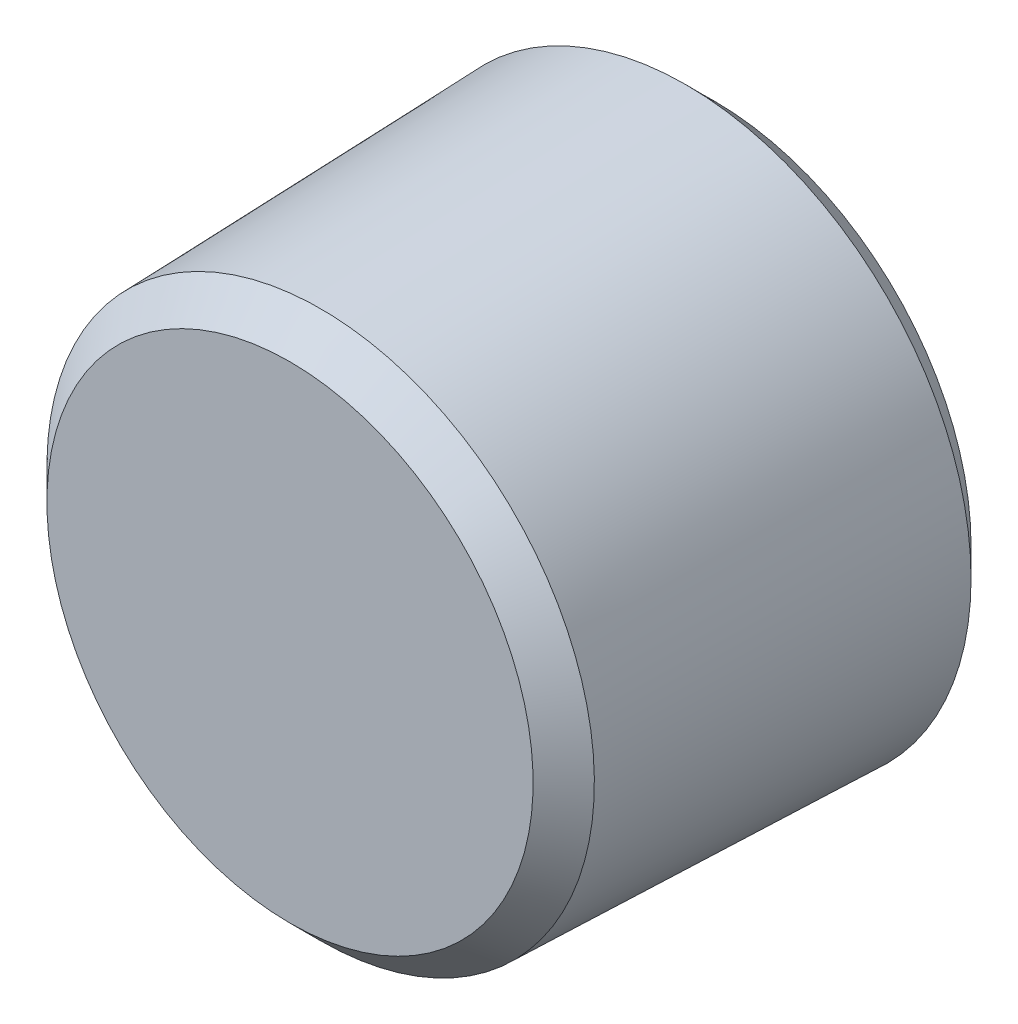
ISO-10303-21;
HEADER;
FILE_DESCRIPTION(('STEP AP214'),'2;1');
FILE_NAME('part.step','',(''),(''),'','','');
FILE_SCHEMA(('AUTOMOTIVE_DESIGN { 1 0 10303 214 1 1 1 1 }'));
ENDSEC;
DATA;
#1=APPLICATION_CONTEXT('core data for automotive mechanical design processes');
#2=APPLICATION_PROTOCOL_DEFINITION('international standard','automotive_design',2000,#1);
#3=PRODUCT_CONTEXT('',#1,'mechanical');
#4=PRODUCT('Part','Part','',(#3));
#5=PRODUCT_RELATED_PRODUCT_CATEGORY('part','',(#4));
#6=PRODUCT_DEFINITION_FORMATION('','',#4);
#7=PRODUCT_DEFINITION_CONTEXT('part definition',#1,'design');
#8=PRODUCT_DEFINITION('design','',#6,#7);
#9=PRODUCT_DEFINITION_SHAPE('','',#8);
#10=(LENGTH_UNIT() NAMED_UNIT(*) SI_UNIT(.MILLI.,.METRE.));
#11=(NAMED_UNIT(*) PLANE_ANGLE_UNIT() SI_UNIT($,.RADIAN.));
#12=(NAMED_UNIT(*) SI_UNIT($,.STERADIAN.) SOLID_ANGLE_UNIT());
#13=UNCERTAINTY_MEASURE_WITH_UNIT(LENGTH_MEASURE(1.E-05),#10,'distance_accuracy_value','');
#14=(GEOMETRIC_REPRESENTATION_CONTEXT(3) GLOBAL_UNCERTAINTY_ASSIGNED_CONTEXT((#13)) GLOBAL_UNIT_ASSIGNED_CONTEXT((#10,
#11,#12)) REPRESENTATION_CONTEXT('',''));
#15=CARTESIAN_POINT('',(0.,0.,0.));
#16=DIRECTION('',(0.,0.,1.));
#17=DIRECTION('',(1.,0.,0.));
#18=AXIS2_PLACEMENT_3D('',#15,#16,#17);
#19=CARTESIAN_POINT('',(0.,3.5,0.));
#20=DIRECTION('',(0.,0.,1.));
#21=DIRECTION('',(0.,-1.,0.));
#22=AXIS2_PLACEMENT_3D('',#19,#20,#21);
#23=PLANE('',#22);
#24=CARTESIAN_POINT('',(0.,0.,0.));
#25=DIRECTION('',(0.,0.,1.));
#26=DIRECTION('',(0.,-1.,0.));
#27=AXIS2_PLACEMENT_3D('',#24,#25,#26);
#28=CIRCLE('',#27,6.02764781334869);
#29=CARTESIAN_POINT('',(0.,-6.02764781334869,0.));
#30=VERTEX_POINT('',#29);
#31=EDGE_CURVE('E140',#30,#30,#28,.T.);
#32=ORIENTED_EDGE('',*,*,#31,.F.);
#33=EDGE_LOOP('',(#32));
#34=FACE_BOUND('',#33,.T.);
#35=DIRECTION('',(-0.5,0.866025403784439,0.));
#36=VECTOR('',#35,1.);
#37=CARTESIAN_POINT('',(4.04145188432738,0.,0.));
#38=LINE('',#37,#36);
#39=CARTESIAN_POINT('',(4.04145188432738,0.,0.));
#40=VERTEX_POINT('',#39);
#41=CARTESIAN_POINT('',(2.02072594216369,3.5,0.));
#42=VERTEX_POINT('',#41);
#43=EDGE_CURVE('E194',#40,#42,#38,.T.);
#44=ORIENTED_EDGE('',*,*,#43,.T.);
#45=DIRECTION('',(-1.,0.,0.));
#46=VECTOR('',#45,1.);
#47=CARTESIAN_POINT('',(2.02072594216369,3.5,0.));
#48=LINE('',#47,#46);
#49=CARTESIAN_POINT('',(-2.02072594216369,3.5,0.));
#50=VERTEX_POINT('',#49);
#51=EDGE_CURVE('E197',#42,#50,#48,.T.);
#52=ORIENTED_EDGE('',*,*,#51,.T.);
#53=DIRECTION('',(-0.5,-0.866025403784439,0.));
#54=VECTOR('',#53,1.);
#55=CARTESIAN_POINT('',(-2.02072594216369,3.5,0.));
#56=LINE('',#55,#54);
#57=CARTESIAN_POINT('',(-4.04145188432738,0.,0.));
#58=VERTEX_POINT('',#57);
#59=EDGE_CURVE('E213',#50,#58,#56,.T.);
#60=ORIENTED_EDGE('',*,*,#59,.T.);
#61=DIRECTION('',(0.5,-0.866025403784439,0.));
#62=VECTOR('',#61,1.);
#63=CARTESIAN_POINT('',(-4.04145188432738,0.,0.));
#64=LINE('',#63,#62);
#65=CARTESIAN_POINT('',(-2.02072594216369,-3.5,0.));
#66=VERTEX_POINT('',#65);
#67=EDGE_CURVE('E119',#58,#66,#64,.T.);
#68=ORIENTED_EDGE('',*,*,#67,.T.);
#69=DIRECTION('',(1.,0.,0.));
#70=VECTOR('',#69,1.);
#71=CARTESIAN_POINT('',(-2.02072594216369,-3.5,0.));
#72=LINE('',#71,#70);
#73=CARTESIAN_POINT('',(2.02072594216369,-3.5,0.));
#74=VERTEX_POINT('',#73);
#75=EDGE_CURVE('E237',#66,#74,#72,.T.);
#76=ORIENTED_EDGE('',*,*,#75,.T.);
#77=DIRECTION('',(0.5,0.866025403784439,0.));
#78=VECTOR('',#77,1.);
#79=CARTESIAN_POINT('',(2.02072594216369,-3.5,0.));
#80=LINE('',#79,#78);
#81=EDGE_CURVE('E130',#74,#40,#80,.T.);
#82=ORIENTED_EDGE('',*,*,#81,.T.);
#83=EDGE_LOOP('',(#44,#52,#60,#68,#76,#82));
#84=FACE_BOUND('',#83,.T.);
#85=ADVANCED_FACE('F36',(#34,#84),#23,.F.);
#86=CARTESIAN_POINT('',(0.,0.,10.));
#87=DIRECTION('',(0.,0.,-1.));
#88=DIRECTION('',(0.,1.,0.));
#89=AXIS2_PLACEMENT_3D('',#86,#87,#88);
#90=PLANE('',#89);
#91=CARTESIAN_POINT('',(0.,0.,10.));
#92=DIRECTION('',(0.,0.,1.));
#93=DIRECTION('',(0.,-1.,0.));
#94=AXIS2_PLACEMENT_3D('',#91,#92,#93);
#95=CIRCLE('',#94,5.725);
#96=CARTESIAN_POINT('',(0.,-5.725,10.));
#97=VERTEX_POINT('',#96);
#98=EDGE_CURVE('E11',#97,#97,#95,.T.);
#99=ORIENTED_EDGE('',*,*,#98,.T.);
#100=EDGE_LOOP('',(#99));
#101=FACE_BOUND('',#100,.T.);
#102=ADVANCED_FACE('F38',(#101),#90,.F.);
#103=CARTESIAN_POINT('',(0.,0.,9.27877712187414));
#104=DIRECTION('',(0.,0.,-1.));
#105=DIRECTION('',(0.,1.,0.));
#106=AXIS2_PLACEMENT_3D('',#103,#104,#105);
#107=CONICAL_SURFACE('',#106,6.44622287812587,0.785398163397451);
#108=ORIENTED_EDGE('',*,*,#98,.F.);
#109=EDGE_LOOP('',(#108));
#110=FACE_BOUND('',#109,.T.);
#111=CARTESIAN_POINT('',(0.,0.,9.27877712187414));
#112=DIRECTION('',(0.,0.,1.));
#113=DIRECTION('',(0.,-1.,0.));
#114=AXIS2_PLACEMENT_3D('',#111,#112,#113);
#115=CIRCLE('',#114,6.44622287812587);
#116=CARTESIAN_POINT('',(0.,-6.44622287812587,9.27877712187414));
#117=VERTEX_POINT('',#116);
#118=EDGE_CURVE('E44',#117,#117,#115,.T.);
#119=ORIENTED_EDGE('',*,*,#118,.T.);
#120=EDGE_LOOP('',(#119));
#121=FACE_BOUND('',#120,.T.);
#122=ADVANCED_FACE('F158',(#110,#121),#107,.T.);
#123=CARTESIAN_POINT('',(0.,0.,0.677491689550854));
#124=DIRECTION('',(0.,0.,-1.));
#125=DIRECTION('',(0.,1.,0.));
#126=AXIS2_PLACEMENT_3D('',#123,#124,#125);
#127=CONICAL_SURFACE('',#126,6.71514438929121,0.0312550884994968);
#128=ORIENTED_EDGE('',*,*,#118,.F.);
#129=EDGE_LOOP('',(#128));
#130=FACE_BOUND('',#129,.T.);
#131=CARTESIAN_POINT('',(0.,0.,0.677491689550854));
#132=DIRECTION('',(0.,0.,1.));
#133=DIRECTION('',(0.,-1.,0.));
#134=AXIS2_PLACEMENT_3D('',#131,#132,#133);
#135=CIRCLE('',#134,6.71514438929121);
#136=CARTESIAN_POINT('',(0.,-6.71514438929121,0.677491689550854));
#137=VERTEX_POINT('',#136);
#138=EDGE_CURVE('E153',#137,#137,#135,.T.);
#139=ORIENTED_EDGE('',*,*,#138,.T.);
#140=EDGE_LOOP('',(#139));
#141=FACE_BOUND('',#140,.T.);
#142=ADVANCED_FACE('F160',(#130,#141),#127,.T.);
#143=CARTESIAN_POINT('',(0.,0.,0.));
#144=DIRECTION('',(0.,0.,1.));
#145=DIRECTION('',(0.,-1.,0.));
#146=AXIS2_PLACEMENT_3D('',#143,#144,#145);
#147=CONICAL_SURFACE('',#146,6.03765269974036,0.785398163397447);
#148=ORIENTED_EDGE('',*,*,#138,.F.);
#149=EDGE_LOOP('',(#148));
#150=FACE_BOUND('',#149,.T.);
#151=CARTESIAN_POINT('',(0.,0.,0.));
#152=DIRECTION('',(0.,0.,1.));
#153=DIRECTION('',(0.,-1.,0.));
#154=AXIS2_PLACEMENT_3D('',#151,#152,#153);
#155=CIRCLE('',#154,6.03765269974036);
#156=CARTESIAN_POINT('',(0.,-6.03765269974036,0.));
#157=VERTEX_POINT('',#156);
#158=EDGE_CURVE('E150',#157,#157,#155,.T.);
#159=ORIENTED_EDGE('',*,*,#158,.T.);
#160=EDGE_LOOP('',(#159));
#161=FACE_BOUND('',#160,.T.);
#162=ADVANCED_FACE('F163',(#150,#161),#147,.T.);
#163=CARTESIAN_POINT('',(0.,0.,9.99));
#164=DIRECTION('',(0.,0.,-1.));
#165=DIRECTION('',(0.,1.,0.));
#166=AXIS2_PLACEMENT_3D('',#163,#164,#165);
#167=CONICAL_SURFACE('',#166,5.72531265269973,0.0312550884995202);
#168=ORIENTED_EDGE('',*,*,#158,.F.);
#169=EDGE_LOOP('',(#168));
#170=FACE_BOUND('',#169,.T.);
#171=CARTESIAN_POINT('',(0.,0.,9.99));
#172=DIRECTION('',(0.,0.,1.));
#173=DIRECTION('',(0.,-1.,0.));
#174=AXIS2_PLACEMENT_3D('',#171,#172,#173);
#175=CIRCLE('',#174,5.72531265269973);
#176=CARTESIAN_POINT('',(0.,-5.72531265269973,9.99));
#177=VERTEX_POINT('',#176);
#178=EDGE_CURVE('E147',#177,#177,#175,.T.);
#179=ORIENTED_EDGE('',*,*,#178,.T.);
#180=EDGE_LOOP('',(#179));
#181=FACE_BOUND('',#180,.T.);
#182=ADVANCED_FACE('F169',(#170,#181),#167,.F.);
#183=CARTESIAN_POINT('',(0.,5.72531265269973,9.99));
#184=DIRECTION('',(0.,0.,1.));
#185=DIRECTION('',(0.,-1.,0.));
#186=AXIS2_PLACEMENT_3D('',#183,#184,#185);
#187=PLANE('',#186);
#188=ORIENTED_EDGE('',*,*,#178,.F.);
#189=EDGE_LOOP('',(#188));
#190=FACE_BOUND('',#189,.T.);
#191=CARTESIAN_POINT('',(0.,0.,9.99));
#192=DIRECTION('',(0.,0.,1.));
#193=DIRECTION('',(0.,-1.,0.));
#194=AXIS2_PLACEMENT_3D('',#191,#192,#193);
#195=CIRCLE('',#194,5.71530776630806);
#196=CARTESIAN_POINT('',(0.,-5.71530776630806,9.99));
#197=VERTEX_POINT('',#196);
#198=EDGE_CURVE('E144',#197,#197,#195,.T.);
#199=ORIENTED_EDGE('',*,*,#198,.T.);
#200=EDGE_LOOP('',(#199));
#201=FACE_BOUND('',#200,.T.);
#202=ADVANCED_FACE('F175',(#190,#201),#187,.F.);
#203=CARTESIAN_POINT('',(0.,0.,0.));
#204=DIRECTION('',(0.,0.,-1.));
#205=DIRECTION('',(0.,1.,0.));
#206=AXIS2_PLACEMENT_3D('',#203,#204,#205);
#207=CONICAL_SURFACE('',#206,6.02764781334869,0.0312550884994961);
#208=ORIENTED_EDGE('',*,*,#198,.F.);
#209=EDGE_LOOP('',(#208));
#210=FACE_BOUND('',#209,.T.);
#211=ORIENTED_EDGE('',*,*,#31,.T.);
#212=EDGE_LOOP('',(#211));
#213=FACE_BOUND('',#212,.T.);
#214=ADVANCED_FACE('F181',(#210,#213),#207,.T.);
#215=CARTESIAN_POINT('',(-2.02072594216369,-3.5,7.));
#216=DIRECTION('',(0.,1.,0.));
#217=DIRECTION('',(0.,0.,1.));
#218=AXIS2_PLACEMENT_3D('',#215,#216,#217);
#219=PLANE('',#218);
#220=DIRECTION('',(1.,0.,0.));
#221=VECTOR('',#220,1.);
#222=CARTESIAN_POINT('',(-2.02072594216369,-3.5,7.));
#223=LINE('',#222,#221);
#224=CARTESIAN_POINT('',(-2.02072594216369,-3.5,7.));
#225=VERTEX_POINT('',#224);
#226=CARTESIAN_POINT('',(0.,-3.5,7.));
#227=VERTEX_POINT('',#226);
#228=EDGE_CURVE('E115',#225,#227,#223,.T.);
#229=ORIENTED_EDGE('',*,*,#228,.T.);
#230=CARTESIAN_POINT('',(2.02072594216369,-3.5,7.));
#231=VERTEX_POINT('',#230);
#232=EDGE_CURVE('E109',#227,#231,#223,.T.);
#233=ORIENTED_EDGE('',*,*,#232,.T.);
#234=DIRECTION('',(0.,0.,-1.));
#235=VECTOR('',#234,1.);
#236=CARTESIAN_POINT('',(2.02072594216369,-3.5,7.));
#237=LINE('',#236,#235);
#238=EDGE_CURVE('E112',#231,#74,#237,.T.);
#239=ORIENTED_EDGE('',*,*,#238,.T.);
#240=ORIENTED_EDGE('',*,*,#75,.F.);
#241=DIRECTION('',(0.,0.,-1.));
#242=VECTOR('',#241,1.);
#243=CARTESIAN_POINT('',(-2.02072594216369,-3.5,7.));
#244=LINE('',#243,#242);
#245=EDGE_CURVE('E219',#225,#66,#244,.T.);
#246=ORIENTED_EDGE('',*,*,#245,.F.);
#247=EDGE_LOOP('',(#229,#233,#239,#240,#246));
#248=FACE_BOUND('',#247,.T.);
#249=ADVANCED_FACE('F110',(#248),#219,.T.);
#250=CARTESIAN_POINT('',(2.02072594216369,-3.5,7.));
#251=DIRECTION('',(-0.866025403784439,0.5,0.));
#252=DIRECTION('',(-0.5,-0.866025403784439,0.));
#253=AXIS2_PLACEMENT_3D('',#250,#251,#252);
#254=PLANE('',#253);
#255=DIRECTION('',(0.5,0.866025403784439,0.));
#256=VECTOR('',#255,1.);
#257=CARTESIAN_POINT('',(2.02072594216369,-3.5,7.));
#258=LINE('',#257,#256);
#259=CARTESIAN_POINT('',(3.03108891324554,-1.75,7.));
#260=VERTEX_POINT('',#259);
#261=EDGE_CURVE('E51',#231,#260,#258,.T.);
#262=ORIENTED_EDGE('',*,*,#261,.T.);
#263=CARTESIAN_POINT('',(4.04145188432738,0.,7.));
#264=VERTEX_POINT('',#263);
#265=EDGE_CURVE('E125',#260,#264,#258,.T.);
#266=ORIENTED_EDGE('',*,*,#265,.T.);
#267=DIRECTION('',(0.,0.,-1.));
#268=VECTOR('',#267,1.);
#269=CARTESIAN_POINT('',(4.04145188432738,0.,7.));
#270=LINE('',#269,#268);
#271=EDGE_CURVE('E132',#264,#40,#270,.T.);
#272=ORIENTED_EDGE('',*,*,#271,.T.);
#273=ORIENTED_EDGE('',*,*,#81,.F.);
#274=ORIENTED_EDGE('',*,*,#238,.F.);
#275=EDGE_LOOP('',(#262,#266,#272,#273,#274));
#276=FACE_BOUND('',#275,.T.);
#277=ADVANCED_FACE('F128',(#276),#254,.T.);
#278=CARTESIAN_POINT('',(4.04145188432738,0.,7.));
#279=DIRECTION('',(-0.866025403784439,-0.5,0.));
#280=DIRECTION('',(0.5,-0.866025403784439,0.));
#281=AXIS2_PLACEMENT_3D('',#278,#279,#280);
#282=PLANE('',#281);
#283=DIRECTION('',(-0.5,0.866025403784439,0.));
#284=VECTOR('',#283,1.);
#285=CARTESIAN_POINT('',(4.04145188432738,0.,7.));
#286=LINE('',#285,#284);
#287=CARTESIAN_POINT('',(3.03108891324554,1.75,7.));
#288=VERTEX_POINT('',#287);
#289=EDGE_CURVE('E247',#264,#288,#286,.T.);
#290=ORIENTED_EDGE('',*,*,#289,.T.);
#291=CARTESIAN_POINT('',(2.02072594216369,3.5,7.));
#292=VERTEX_POINT('',#291);
#293=EDGE_CURVE('E124',#288,#292,#286,.T.);
#294=ORIENTED_EDGE('',*,*,#293,.T.);
#295=DIRECTION('',(0.,0.,-1.));
#296=VECTOR('',#295,1.);
#297=CARTESIAN_POINT('',(2.02072594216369,3.5,7.));
#298=LINE('',#297,#296);
#299=EDGE_CURVE('E136',#292,#42,#298,.T.);
#300=ORIENTED_EDGE('',*,*,#299,.T.);
#301=ORIENTED_EDGE('',*,*,#43,.F.);
#302=ORIENTED_EDGE('',*,*,#271,.F.);
#303=EDGE_LOOP('',(#290,#294,#300,#301,#302));
#304=FACE_BOUND('',#303,.T.);
#305=ADVANCED_FACE('F204',(#304),#282,.T.);
#306=CARTESIAN_POINT('',(2.02072594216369,3.5,7.));
#307=DIRECTION('',(0.,-1.,0.));
#308=DIRECTION('',(0.,0.,-1.));
#309=AXIS2_PLACEMENT_3D('',#306,#307,#308);
#310=PLANE('',#309);
#311=DIRECTION('',(-1.,0.,0.));
#312=VECTOR('',#311,1.);
#313=CARTESIAN_POINT('',(2.02072594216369,3.5,7.));
#314=LINE('',#313,#312);
#315=CARTESIAN_POINT('',(0.,3.5,7.));
#316=VERTEX_POINT('',#315);
#317=EDGE_CURVE('E244',#292,#316,#314,.T.);
#318=ORIENTED_EDGE('',*,*,#317,.T.);
#319=CARTESIAN_POINT('',(-2.02072594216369,3.5,7.));
#320=VERTEX_POINT('',#319);
#321=EDGE_CURVE('E246',#316,#320,#314,.T.);
#322=ORIENTED_EDGE('',*,*,#321,.T.);
#323=DIRECTION('',(0.,0.,-1.));
#324=VECTOR('',#323,1.);
#325=CARTESIAN_POINT('',(-2.02072594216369,3.5,7.));
#326=LINE('',#325,#324);
#327=EDGE_CURVE('E209',#320,#50,#326,.T.);
#328=ORIENTED_EDGE('',*,*,#327,.T.);
#329=ORIENTED_EDGE('',*,*,#51,.F.);
#330=ORIENTED_EDGE('',*,*,#299,.F.);
#331=EDGE_LOOP('',(#318,#322,#328,#329,#330));
#332=FACE_BOUND('',#331,.T.);
#333=ADVANCED_FACE('F210',(#332),#310,.T.);
#334=CARTESIAN_POINT('',(-2.02072594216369,3.5,7.));
#335=DIRECTION('',(0.866025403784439,-0.5,0.));
#336=DIRECTION('',(0.5,0.866025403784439,0.));
#337=AXIS2_PLACEMENT_3D('',#334,#335,#336);
#338=PLANE('',#337);
#339=DIRECTION('',(-0.5,-0.866025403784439,0.));
#340=VECTOR('',#339,1.);
#341=CARTESIAN_POINT('',(-2.02072594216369,3.5,7.));
#342=LINE('',#341,#340);
#343=CARTESIAN_POINT('',(-3.03108891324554,1.75,7.));
#344=VERTEX_POINT('',#343);
#345=EDGE_CURVE('E242',#320,#344,#342,.T.);
#346=ORIENTED_EDGE('',*,*,#345,.T.);
#347=CARTESIAN_POINT('',(-4.04145188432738,0.,7.));
#348=VERTEX_POINT('',#347);
#349=EDGE_CURVE('E232',#344,#348,#342,.T.);
#350=ORIENTED_EDGE('',*,*,#349,.T.);
#351=DIRECTION('',(0.,0.,-1.));
#352=VECTOR('',#351,1.);
#353=CARTESIAN_POINT('',(-4.04145188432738,0.,7.));
#354=LINE('',#353,#352);
#355=EDGE_CURVE('E222',#348,#58,#354,.T.);
#356=ORIENTED_EDGE('',*,*,#355,.T.);
#357=ORIENTED_EDGE('',*,*,#59,.F.);
#358=ORIENTED_EDGE('',*,*,#327,.F.);
#359=EDGE_LOOP('',(#346,#350,#356,#357,#358));
#360=FACE_BOUND('',#359,.T.);
#361=ADVANCED_FACE('F230',(#360),#338,.T.);
#362=CARTESIAN_POINT('',(-4.04145188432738,0.,7.));
#363=DIRECTION('',(0.866025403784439,0.5,0.));
#364=DIRECTION('',(-0.5,0.866025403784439,0.));
#365=AXIS2_PLACEMENT_3D('',#362,#363,#364);
#366=PLANE('',#365);
#367=DIRECTION('',(0.5,-0.866025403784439,0.));
#368=VECTOR('',#367,1.);
#369=CARTESIAN_POINT('',(-4.04145188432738,0.,7.));
#370=LINE('',#369,#368);
#371=CARTESIAN_POINT('',(-3.03108891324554,-1.75,7.));
#372=VERTEX_POINT('',#371);
#373=EDGE_CURVE('E223',#348,#372,#370,.T.);
#374=ORIENTED_EDGE('',*,*,#373,.T.);
#375=EDGE_CURVE('E241',#372,#225,#370,.T.);
#376=ORIENTED_EDGE('',*,*,#375,.T.);
#377=ORIENTED_EDGE('',*,*,#245,.T.);
#378=ORIENTED_EDGE('',*,*,#67,.F.);
#379=ORIENTED_EDGE('',*,*,#355,.F.);
#380=EDGE_LOOP('',(#374,#376,#377,#378,#379));
#381=FACE_BOUND('',#380,.T.);
#382=ADVANCED_FACE('F236',(#381),#366,.T.);
#383=CARTESIAN_POINT('',(0.,0.,7.));
#384=DIRECTION('',(0.,0.,1.));
#385=DIRECTION('',(1.,0.,0.));
#386=AXIS2_PLACEMENT_3D('',#383,#384,#385);
#387=PLANE('',#386);
#388=ORIENTED_EDGE('',*,*,#261,.F.);
#389=ORIENTED_EDGE('',*,*,#232,.F.);
#390=CARTESIAN_POINT('',(0.,0.,7.));
#391=DIRECTION('',(0.,0.,1.));
#392=DIRECTION('',(0.,-1.,0.));
#393=AXIS2_PLACEMENT_3D('',#390,#391,#392);
#394=CIRCLE('',#393,3.5);
#395=EDGE_CURVE('E122',#227,#260,#394,.T.);
#396=ORIENTED_EDGE('',*,*,#395,.T.);
#397=EDGE_LOOP('',(#388,#389,#396));
#398=FACE_BOUND('',#397,.T.);
#399=ADVANCED_FACE('F121',(#398),#387,.F.);
#400=ORIENTED_EDGE('',*,*,#228,.F.);
#401=ORIENTED_EDGE('',*,*,#375,.F.);
#402=EDGE_CURVE('E131',#372,#227,#394,.T.);
#403=ORIENTED_EDGE('',*,*,#402,.T.);
#404=EDGE_LOOP('',(#400,#401,#403));
#405=FACE_BOUND('',#404,.T.);
#406=ADVANCED_FACE('F268',(#405),#387,.F.);
#407=ORIENTED_EDGE('',*,*,#373,.F.);
#408=ORIENTED_EDGE('',*,*,#349,.F.);
#409=EDGE_CURVE('E134',#344,#372,#394,.T.);
#410=ORIENTED_EDGE('',*,*,#409,.T.);
#411=EDGE_LOOP('',(#407,#408,#410));
#412=FACE_BOUND('',#411,.T.);
#413=ADVANCED_FACE('F266',(#412),#387,.F.);
#414=ORIENTED_EDGE('',*,*,#345,.F.);
#415=ORIENTED_EDGE('',*,*,#321,.F.);
#416=EDGE_CURVE('E259',#316,#344,#394,.T.);
#417=ORIENTED_EDGE('',*,*,#416,.T.);
#418=EDGE_LOOP('',(#414,#415,#417));
#419=FACE_BOUND('',#418,.T.);
#420=ADVANCED_FACE('F275',(#419),#387,.F.);
#421=ORIENTED_EDGE('',*,*,#317,.F.);
#422=ORIENTED_EDGE('',*,*,#293,.F.);
#423=EDGE_CURVE('E253',#288,#316,#394,.T.);
#424=ORIENTED_EDGE('',*,*,#423,.T.);
#425=EDGE_LOOP('',(#421,#422,#424));
#426=FACE_BOUND('',#425,.T.);
#427=ADVANCED_FACE('F255',(#426),#387,.F.);
#428=ORIENTED_EDGE('',*,*,#289,.F.);
#429=ORIENTED_EDGE('',*,*,#265,.F.);
#430=EDGE_CURVE('E141',#260,#288,#394,.T.);
#431=ORIENTED_EDGE('',*,*,#430,.T.);
#432=EDGE_LOOP('',(#428,#429,#431));
#433=FACE_BOUND('',#432,.T.);
#434=ADVANCED_FACE('F251',(#433),#387,.F.);
#435=CARTESIAN_POINT('',(0.,0.,9.10301216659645));
#436=DIRECTION('',(0.,0.,-1.));
#437=DIRECTION('',(0.,1.,0.));
#438=AXIS2_PLACEMENT_3D('',#435,#436,#437);
#439=CONICAL_SURFACE('',#438,0.,1.02974425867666);
#440=ORIENTED_EDGE('',*,*,#395,.F.);
#441=ORIENTED_EDGE('',*,*,#402,.F.);
#442=ORIENTED_EDGE('',*,*,#409,.F.);
#443=ORIENTED_EDGE('',*,*,#416,.F.);
#444=ORIENTED_EDGE('',*,*,#423,.F.);
#445=ORIENTED_EDGE('',*,*,#430,.F.);
#446=EDGE_LOOP('',(#440,#441,#442,#443,#444,#445));
#447=FACE_BOUND('',#446,.T.);
#448=CARTESIAN_POINT('',(0.,0.,9.10301216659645));
#449=VERTEX_POINT('',#448);
#450=VERTEX_LOOP('',#449);
#451=FACE_BOUND('',#450,.T.);
#452=ADVANCED_FACE('F260',(#447,#451),#439,.F.);
#453=CLOSED_SHELL('',(#85,#102,#122,#142,#162,#182,#202,#214,#249,#277,#305,#333,#361,#382,#399,
#406,#413,#420,#427,#434,#452));
#454=MANIFOLD_SOLID_BREP('B2',#453);
#455=ADVANCED_BREP_SHAPE_REPRESENTATION('',(#18,#454),#14);
#456=SHAPE_DEFINITION_REPRESENTATION(#9,#455);
ENDSEC;
END-ISO-10303-21;
